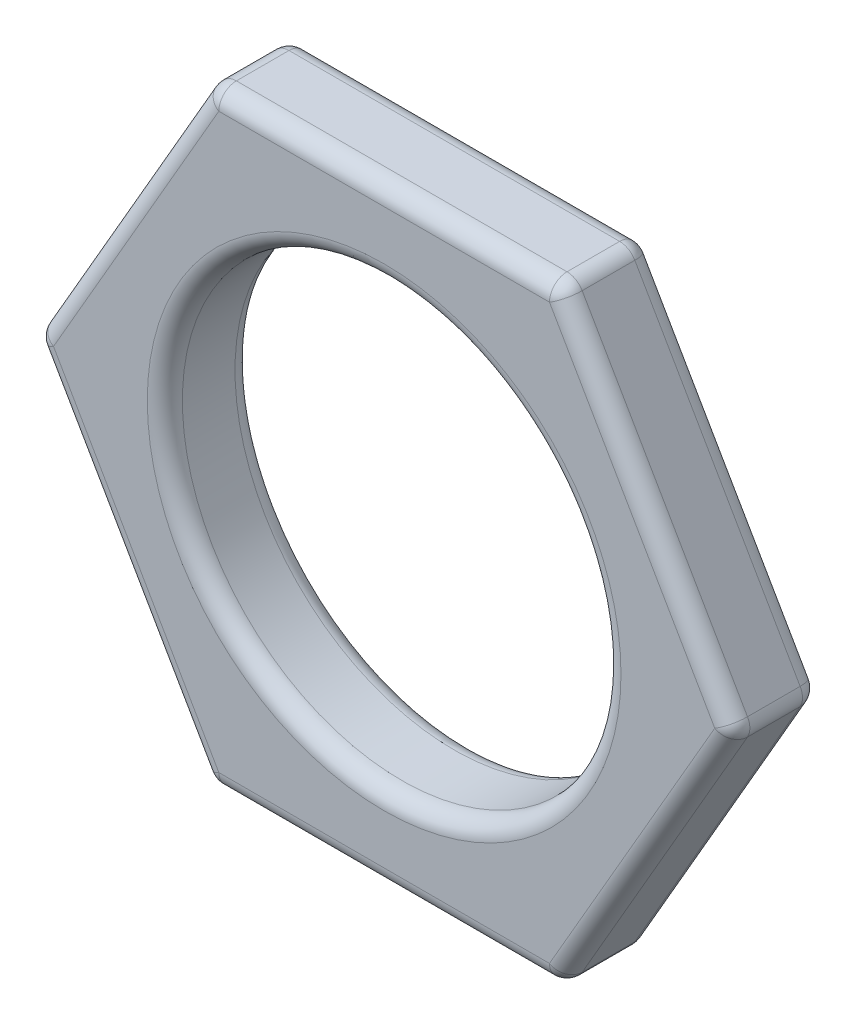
ISO-10303-21;
HEADER;
FILE_DESCRIPTION(('STEP AP214'),'2;1');
FILE_NAME('part.step','',(''),(''),'','','');
FILE_SCHEMA(('AUTOMOTIVE_DESIGN { 1 0 10303 214 1 1 1 1 }'));
ENDSEC;
DATA;
#1=APPLICATION_CONTEXT('core data for automotive mechanical design processes');
#2=APPLICATION_PROTOCOL_DEFINITION('international standard','automotive_design',2000,#1);
#3=PRODUCT_CONTEXT('',#1,'mechanical');
#4=PRODUCT('Part','Part','',(#3));
#5=PRODUCT_RELATED_PRODUCT_CATEGORY('part','',(#4));
#6=PRODUCT_DEFINITION_FORMATION('','',#4);
#7=PRODUCT_DEFINITION_CONTEXT('part definition',#1,'design');
#8=PRODUCT_DEFINITION('design','',#6,#7);
#9=PRODUCT_DEFINITION_SHAPE('','',#8);
#10=(LENGTH_UNIT() NAMED_UNIT(*) SI_UNIT(.MILLI.,.METRE.));
#11=(NAMED_UNIT(*) PLANE_ANGLE_UNIT() SI_UNIT($,.RADIAN.));
#12=(NAMED_UNIT(*) SI_UNIT($,.STERADIAN.) SOLID_ANGLE_UNIT());
#13=UNCERTAINTY_MEASURE_WITH_UNIT(LENGTH_MEASURE(1.E-05),#10,'distance_accuracy_value','');
#14=(GEOMETRIC_REPRESENTATION_CONTEXT(3) GLOBAL_UNCERTAINTY_ASSIGNED_CONTEXT((#13)) GLOBAL_UNIT_ASSIGNED_CONTEXT((#10,
#11,#12)) REPRESENTATION_CONTEXT('',''));
#15=CARTESIAN_POINT('',(0.,0.,0.));
#16=DIRECTION('',(0.,0.,1.));
#17=DIRECTION('',(1.,0.,0.));
#18=AXIS2_PLACEMENT_3D('',#15,#16,#17);
#19=CARTESIAN_POINT('',(9.525,5.4992613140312,1.5875));
#20=DIRECTION('',(0.,0.,1.));
#21=DIRECTION('',(1.,0.,0.));
#22=AXIS2_PLACEMENT_3D('',#19,#20,#21);
#23=PLANE('',#22);
#24=CARTESIAN_POINT('',(0.,0.,1.5875));
#25=DIRECTION('',(0.,0.,1.));
#26=DIRECTION('',(1.,0.,0.));
#27=AXIS2_PLACEMENT_3D('',#24,#25,#26);
#28=CIRCLE('',#27,4.28625);
#29=CARTESIAN_POINT('',(4.28625,0.,1.5875));
#30=VERTEX_POINT('',#29);
#31=EDGE_CURVE('E11',#30,#30,#28,.F.);
#32=ORIENTED_EDGE('',*,*,#31,.T.);
#33=EDGE_LOOP('',(#32));
#34=FACE_BOUND('',#33,.T.);
#35=DIRECTION('',(0.500000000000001,-0.866025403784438,0.));
#36=VECTOR('',#35,1.);
#37=CARTESIAN_POINT('',(-2.90003693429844,-5.34051131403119,1.5875));
#38=LINE('',#37,#36);
#39=CARTESIAN_POINT('',(-5.9833825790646,0.,1.5875));
#40=VERTEX_POINT('',#39);
#41=CARTESIAN_POINT('',(-2.99169128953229,-5.18176131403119,1.5875));
#42=VERTEX_POINT('',#41);
#43=EDGE_CURVE('E59',#40,#42,#38,.T.);
#44=ORIENTED_EDGE('',*,*,#43,.T.);
#45=DIRECTION('',(1.,0.,0.));
#46=VECTOR('',#45,1.);
#47=CARTESIAN_POINT('',(3.17500000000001,-5.18176131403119,1.5875));
#48=LINE('',#47,#46);
#49=CARTESIAN_POINT('',(2.9916912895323,-5.18176131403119,1.5875));
#50=VERTEX_POINT('',#49);
#51=EDGE_CURVE('E49',#42,#50,#48,.T.);
#52=ORIENTED_EDGE('',*,*,#51,.T.);
#53=DIRECTION('',(0.499999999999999,0.866025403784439,0.));
#54=VECTOR('',#53,1.);
#55=CARTESIAN_POINT('',(6.07503693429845,0.158750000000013,1.5875));
#56=LINE('',#55,#54);
#57=CARTESIAN_POINT('',(5.9833825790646,0.,1.5875));
#58=VERTEX_POINT('',#57);
#59=EDGE_CURVE('E277',#50,#58,#56,.T.);
#60=ORIENTED_EDGE('',*,*,#59,.T.);
#61=DIRECTION('',(-0.500000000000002,0.866025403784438,0.));
#62=VECTOR('',#61,1.);
#63=CARTESIAN_POINT('',(2.90003693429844,5.3405113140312,1.5875));
#64=LINE('',#63,#62);
#65=CARTESIAN_POINT('',(2.99169128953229,5.1817613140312,1.5875));
#66=VERTEX_POINT('',#65);
#67=EDGE_CURVE('E279',#58,#66,#64,.T.);
#68=ORIENTED_EDGE('',*,*,#67,.T.);
#69=DIRECTION('',(-1.,0.,0.));
#70=VECTOR('',#69,1.);
#71=CARTESIAN_POINT('',(-3.175,5.1817613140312,1.5875));
#72=LINE('',#71,#70);
#73=CARTESIAN_POINT('',(-2.9916912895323,5.1817613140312,1.5875));
#74=VERTEX_POINT('',#73);
#75=EDGE_CURVE('E278',#66,#74,#72,.T.);
#76=ORIENTED_EDGE('',*,*,#75,.T.);
#77=DIRECTION('',(-0.500000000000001,-0.866025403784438,0.));
#78=VECTOR('',#77,1.);
#79=CARTESIAN_POINT('',(-6.07503693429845,-0.158749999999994,1.5875));
#80=LINE('',#79,#78);
#81=EDGE_CURVE('E62',#74,#40,#80,.T.);
#82=ORIENTED_EDGE('',*,*,#81,.T.);
#83=EDGE_LOOP('',(#44,#52,#60,#68,#76,#82));
#84=FACE_BOUND('',#83,.T.);
#85=ADVANCED_FACE('F41',(#34,#84),#23,.T.);
#86=CARTESIAN_POINT('',(9.525,5.4992613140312,0.));
#87=DIRECTION('',(0.,0.,1.));
#88=DIRECTION('',(1.,0.,0.));
#89=AXIS2_PLACEMENT_3D('',#86,#87,#88);
#90=PLANE('',#89);
#91=CARTESIAN_POINT('',(0.,0.,0.));
#92=DIRECTION('',(0.,0.,1.));
#93=DIRECTION('',(1.,0.,0.));
#94=AXIS2_PLACEMENT_3D('',#91,#92,#93);
#95=CIRCLE('',#94,4.28625);
#96=CARTESIAN_POINT('',(4.28625,0.,0.));
#97=VERTEX_POINT('',#96);
#98=EDGE_CURVE('E270',#97,#97,#95,.T.);
#99=ORIENTED_EDGE('',*,*,#98,.T.);
#100=EDGE_LOOP('',(#99));
#101=FACE_BOUND('',#100,.T.);
#102=DIRECTION('',(-1.,0.,0.));
#103=VECTOR('',#102,1.);
#104=CARTESIAN_POINT('',(9.525,5.1817613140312,0.));
#105=LINE('',#104,#103);
#106=CARTESIAN_POINT('',(-2.99169128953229,5.1817613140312,0.));
#107=VERTEX_POINT('',#106);
#108=CARTESIAN_POINT('',(2.99169128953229,5.1817613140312,0.));
#109=VERTEX_POINT('',#108);
#110=EDGE_CURVE('E265',#107,#109,#105,.F.);
#111=ORIENTED_EDGE('',*,*,#110,.T.);
#112=DIRECTION('',(-0.500000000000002,0.866025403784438,0.));
#113=VECTOR('',#112,1.);
#114=CARTESIAN_POINT('',(4.48753693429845,2.5908806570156,0.));
#115=LINE('',#114,#113);
#116=CARTESIAN_POINT('',(5.9833825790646,0.,0.));
#117=VERTEX_POINT('',#116);
#118=EDGE_CURVE('E262',#109,#117,#115,.F.);
#119=ORIENTED_EDGE('',*,*,#118,.T.);
#120=DIRECTION('',(0.499999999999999,0.866025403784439,0.));
#121=VECTOR('',#120,1.);
#122=CARTESIAN_POINT('',(9.25003693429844,5.65801131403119,0.));
#123=LINE('',#122,#121);
#124=CARTESIAN_POINT('',(2.9916912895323,-5.18176131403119,0.));
#125=VERTEX_POINT('',#124);
#126=EDGE_CURVE('E255',#117,#125,#123,.F.);
#127=ORIENTED_EDGE('',*,*,#126,.T.);
#128=DIRECTION('',(1.,0.,0.));
#129=VECTOR('',#128,1.);
#130=CARTESIAN_POINT('',(9.525,-5.18176131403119,0.));
#131=LINE('',#130,#129);
#132=CARTESIAN_POINT('',(-2.99169128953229,-5.18176131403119,0.));
#133=VERTEX_POINT('',#132);
#134=EDGE_CURVE('E258',#125,#133,#131,.F.);
#135=ORIENTED_EDGE('',*,*,#134,.T.);
#136=DIRECTION('',(0.500000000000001,-0.866025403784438,0.));
#137=VECTOR('',#136,1.);
#138=CARTESIAN_POINT('',(-4.48753693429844,-2.5908806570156,0.));
#139=LINE('',#138,#137);
#140=CARTESIAN_POINT('',(-5.9833825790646,0.,0.));
#141=VERTEX_POINT('',#140);
#142=EDGE_CURVE('E256',#133,#141,#139,.F.);
#143=ORIENTED_EDGE('',*,*,#142,.T.);
#144=DIRECTION('',(-0.500000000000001,-0.866025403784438,0.));
#145=VECTOR('',#144,1.);
#146=CARTESIAN_POINT('',(0.274963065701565,10.8397726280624,0.));
#147=LINE('',#146,#145);
#148=EDGE_CURVE('E257',#141,#107,#147,.F.);
#149=ORIENTED_EDGE('',*,*,#148,.T.);
#150=EDGE_LOOP('',(#111,#119,#127,#135,#143,#149));
#151=FACE_BOUND('',#150,.T.);
#152=ADVANCED_FACE('F382',(#101,#151),#90,.F.);
#153=CARTESIAN_POINT('',(3.17500000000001,-5.49926131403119,1.5875));
#154=DIRECTION('',(-0.866025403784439,0.499999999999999,0.));
#155=DIRECTION('',(-0.499999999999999,-0.866025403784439,0.));
#156=AXIS2_PLACEMENT_3D('',#153,#154,#155);
#157=PLANE('',#156);
#158=DIRECTION('',(0.,0.,-1.));
#159=VECTOR('',#158,1.);
#160=CARTESIAN_POINT('',(3.26665435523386,-5.34051131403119,1.5875));
#161=LINE('',#160,#159);
#162=CARTESIAN_POINT('',(3.26665435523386,-5.34051131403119,1.27));
#163=VERTEX_POINT('',#162);
#164=CARTESIAN_POINT('',(3.26665435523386,-5.34051131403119,0.3175));
#165=VERTEX_POINT('',#164);
#166=EDGE_CURVE('E178',#163,#165,#161,.T.);
#167=ORIENTED_EDGE('',*,*,#166,.T.);
#168=DIRECTION('',(0.499999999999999,0.866025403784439,0.));
#169=VECTOR('',#168,1.);
#170=CARTESIAN_POINT('',(3.17500000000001,-5.49926131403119,0.3175));
#171=LINE('',#170,#169);
#172=CARTESIAN_POINT('',(6.25834564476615,-0.158749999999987,0.3175));
#173=VERTEX_POINT('',#172);
#174=EDGE_CURVE('E174',#165,#173,#171,.T.);
#175=ORIENTED_EDGE('',*,*,#174,.T.);
#176=DIRECTION('',(0.,0.,-1.));
#177=VECTOR('',#176,1.);
#178=CARTESIAN_POINT('',(6.25834564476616,-0.158749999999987,1.5875));
#179=LINE('',#178,#177);
#180=CARTESIAN_POINT('',(6.25834564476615,-0.158749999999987,1.27));
#181=VERTEX_POINT('',#180);
#182=EDGE_CURVE('E170',#173,#181,#179,.F.);
#183=ORIENTED_EDGE('',*,*,#182,.T.);
#184=DIRECTION('',(0.499999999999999,0.866025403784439,0.));
#185=VECTOR('',#184,1.);
#186=CARTESIAN_POINT('',(3.17500000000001,-5.49926131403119,1.27));
#187=LINE('',#186,#185);
#188=EDGE_CURVE('E175',#181,#163,#187,.F.);
#189=ORIENTED_EDGE('',*,*,#188,.T.);
#190=EDGE_LOOP('',(#167,#175,#183,#189));
#191=FACE_BOUND('',#190,.T.);
#192=ADVANCED_FACE('F168',(#191),#157,.F.);
#193=CARTESIAN_POINT('',(6.35000000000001,0.,1.5875));
#194=DIRECTION('',(-0.866025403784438,-0.500000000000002,0.));
#195=DIRECTION('',(0.500000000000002,-0.866025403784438,0.));
#196=AXIS2_PLACEMENT_3D('',#193,#194,#195);
#197=PLANE('',#196);
#198=DIRECTION('',(0.,0.,-1.));
#199=VECTOR('',#198,1.);
#200=CARTESIAN_POINT('',(6.25834564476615,0.158750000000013,1.5875));
#201=LINE('',#200,#199);
#202=CARTESIAN_POINT('',(6.25834564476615,0.158750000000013,1.27));
#203=VERTEX_POINT('',#202);
#204=CARTESIAN_POINT('',(6.25834564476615,0.158750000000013,0.3175));
#205=VERTEX_POINT('',#204);
#206=EDGE_CURVE('E186',#203,#205,#201,.T.);
#207=ORIENTED_EDGE('',*,*,#206,.T.);
#208=DIRECTION('',(-0.500000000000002,0.866025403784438,0.));
#209=VECTOR('',#208,1.);
#210=CARTESIAN_POINT('',(6.35000000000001,0.,0.3175));
#211=LINE('',#210,#209);
#212=CARTESIAN_POINT('',(3.26665435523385,5.3405113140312,0.3175));
#213=VERTEX_POINT('',#212);
#214=EDGE_CURVE('E223',#205,#213,#211,.T.);
#215=ORIENTED_EDGE('',*,*,#214,.T.);
#216=DIRECTION('',(0.,0.,-1.));
#217=VECTOR('',#216,1.);
#218=CARTESIAN_POINT('',(3.26665435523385,5.3405113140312,1.5875));
#219=LINE('',#218,#217);
#220=CARTESIAN_POINT('',(3.26665435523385,5.3405113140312,1.27));
#221=VERTEX_POINT('',#220);
#222=EDGE_CURVE('E225',#213,#221,#219,.F.);
#223=ORIENTED_EDGE('',*,*,#222,.T.);
#224=DIRECTION('',(-0.500000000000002,0.866025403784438,0.));
#225=VECTOR('',#224,1.);
#226=CARTESIAN_POINT('',(6.35000000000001,0.,1.27));
#227=LINE('',#226,#225);
#228=EDGE_CURVE('E219',#221,#203,#227,.F.);
#229=ORIENTED_EDGE('',*,*,#228,.T.);
#230=EDGE_LOOP('',(#207,#215,#223,#229));
#231=FACE_BOUND('',#230,.T.);
#232=ADVANCED_FACE('F488',(#231),#197,.F.);
#233=CARTESIAN_POINT('',(3.175,5.4992613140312,1.5875));
#234=DIRECTION('',(0.,-1.,0.));
#235=DIRECTION('',(0.,0.,-1.));
#236=AXIS2_PLACEMENT_3D('',#233,#234,#235);
#237=PLANE('',#236);
#238=DIRECTION('',(0.,0.,-1.));
#239=VECTOR('',#238,1.);
#240=CARTESIAN_POINT('',(2.99169128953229,5.4992613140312,1.5875));
#241=LINE('',#240,#239);
#242=CARTESIAN_POINT('',(2.99169128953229,5.4992613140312,1.27));
#243=VERTEX_POINT('',#242);
#244=CARTESIAN_POINT('',(2.99169128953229,5.4992613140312,0.3175));
#245=VERTEX_POINT('',#244);
#246=EDGE_CURVE('E234',#243,#245,#241,.T.);
#247=ORIENTED_EDGE('',*,*,#246,.T.);
#248=DIRECTION('',(-1.,0.,0.));
#249=VECTOR('',#248,1.);
#250=CARTESIAN_POINT('',(3.175,5.4992613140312,0.3175));
#251=LINE('',#250,#249);
#252=CARTESIAN_POINT('',(-2.99169128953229,5.4992613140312,0.3175));
#253=VERTEX_POINT('',#252);
#254=EDGE_CURVE('E233',#245,#253,#251,.T.);
#255=ORIENTED_EDGE('',*,*,#254,.T.);
#256=DIRECTION('',(0.,0.,-1.));
#257=VECTOR('',#256,1.);
#258=CARTESIAN_POINT('',(-2.9916912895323,5.4992613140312,1.5875));
#259=LINE('',#258,#257);
#260=CARTESIAN_POINT('',(-2.99169128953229,5.4992613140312,1.27));
#261=VERTEX_POINT('',#260);
#262=EDGE_CURVE('E228',#253,#261,#259,.F.);
#263=ORIENTED_EDGE('',*,*,#262,.T.);
#264=DIRECTION('',(-1.,0.,0.));
#265=VECTOR('',#264,1.);
#266=CARTESIAN_POINT('',(3.175,5.4992613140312,1.27));
#267=LINE('',#266,#265);
#268=EDGE_CURVE('E230',#261,#243,#267,.F.);
#269=ORIENTED_EDGE('',*,*,#268,.T.);
#270=EDGE_LOOP('',(#247,#255,#263,#269));
#271=FACE_BOUND('',#270,.T.);
#272=ADVANCED_FACE('F416',(#271),#237,.F.);
#273=CARTESIAN_POINT('',(-3.175,5.4992613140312,1.5875));
#274=DIRECTION('',(0.866025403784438,-0.500000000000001,0.));
#275=DIRECTION('',(0.500000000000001,0.866025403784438,0.));
#276=AXIS2_PLACEMENT_3D('',#273,#274,#275);
#277=PLANE('',#276);
#278=DIRECTION('',(0.,0.,-1.));
#279=VECTOR('',#278,1.);
#280=CARTESIAN_POINT('',(-3.26665435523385,5.3405113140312,1.5875));
#281=LINE('',#280,#279);
#282=CARTESIAN_POINT('',(-3.26665435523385,5.3405113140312,1.27));
#283=VERTEX_POINT('',#282);
#284=CARTESIAN_POINT('',(-3.26665435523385,5.3405113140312,0.3175));
#285=VERTEX_POINT('',#284);
#286=EDGE_CURVE('E250',#283,#285,#281,.T.);
#287=ORIENTED_EDGE('',*,*,#286,.T.);
#288=DIRECTION('',(-0.500000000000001,-0.866025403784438,0.));
#289=VECTOR('',#288,1.);
#290=CARTESIAN_POINT('',(-3.175,5.4992613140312,0.3175));
#291=LINE('',#290,#289);
#292=CARTESIAN_POINT('',(-6.25834564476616,0.158750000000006,0.3175));
#293=VERTEX_POINT('',#292);
#294=EDGE_CURVE('E252',#285,#293,#291,.T.);
#295=ORIENTED_EDGE('',*,*,#294,.T.);
#296=DIRECTION('',(0.,0.,-1.));
#297=VECTOR('',#296,1.);
#298=CARTESIAN_POINT('',(-6.25834564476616,0.158750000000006,1.5875));
#299=LINE('',#298,#297);
#300=CARTESIAN_POINT('',(-6.25834564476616,0.158750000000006,1.27));
#301=VERTEX_POINT('',#300);
#302=EDGE_CURVE('E249',#293,#301,#299,.F.);
#303=ORIENTED_EDGE('',*,*,#302,.T.);
#304=DIRECTION('',(-0.500000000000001,-0.866025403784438,0.));
#305=VECTOR('',#304,1.);
#306=CARTESIAN_POINT('',(-3.175,5.4992613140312,1.27));
#307=LINE('',#306,#305);
#308=EDGE_CURVE('E242',#301,#283,#307,.F.);
#309=ORIENTED_EDGE('',*,*,#308,.T.);
#310=EDGE_LOOP('',(#287,#295,#303,#309));
#311=FACE_BOUND('',#310,.T.);
#312=ADVANCED_FACE('F395',(#311),#277,.F.);
#313=CARTESIAN_POINT('',(-6.35000000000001,0.,1.5875));
#314=DIRECTION('',(0.866025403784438,0.500000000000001,0.));
#315=DIRECTION('',(-0.500000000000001,0.866025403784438,0.));
#316=AXIS2_PLACEMENT_3D('',#313,#314,#315);
#317=PLANE('',#316);
#318=DIRECTION('',(0.,0.,-1.));
#319=VECTOR('',#318,1.);
#320=CARTESIAN_POINT('',(-6.25834564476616,-0.158749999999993,1.5875));
#321=LINE('',#320,#319);
#322=CARTESIAN_POINT('',(-6.25834564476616,-0.158749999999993,1.27));
#323=VERTEX_POINT('',#322);
#324=CARTESIAN_POINT('',(-6.25834564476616,-0.158749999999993,0.3175));
#325=VERTEX_POINT('',#324);
#326=EDGE_CURVE('E236',#323,#325,#321,.T.);
#327=ORIENTED_EDGE('',*,*,#326,.T.);
#328=DIRECTION('',(0.500000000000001,-0.866025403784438,0.));
#329=VECTOR('',#328,1.);
#330=CARTESIAN_POINT('',(-6.35000000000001,0.,0.3175));
#331=LINE('',#330,#329);
#332=CARTESIAN_POINT('',(-3.26665435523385,-5.34051131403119,0.3175));
#333=VERTEX_POINT('',#332);
#334=EDGE_CURVE('E245',#325,#333,#331,.T.);
#335=ORIENTED_EDGE('',*,*,#334,.T.);
#336=DIRECTION('',(0.,0.,-1.));
#337=VECTOR('',#336,1.);
#338=CARTESIAN_POINT('',(-3.26665435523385,-5.34051131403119,1.5875));
#339=LINE('',#338,#337);
#340=CARTESIAN_POINT('',(-3.26665435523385,-5.34051131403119,1.27));
#341=VERTEX_POINT('',#340);
#342=EDGE_CURVE('E238',#333,#341,#339,.F.);
#343=ORIENTED_EDGE('',*,*,#342,.T.);
#344=DIRECTION('',(0.500000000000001,-0.866025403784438,0.));
#345=VECTOR('',#344,1.);
#346=CARTESIAN_POINT('',(-6.35000000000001,0.,1.27));
#347=LINE('',#346,#345);
#348=EDGE_CURVE('E237',#341,#323,#347,.F.);
#349=ORIENTED_EDGE('',*,*,#348,.T.);
#350=EDGE_LOOP('',(#327,#335,#343,#349));
#351=FACE_BOUND('',#350,.T.);
#352=ADVANCED_FACE('F479',(#351),#317,.F.);
#353=CARTESIAN_POINT('',(-3.175,-5.49926131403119,1.5875));
#354=DIRECTION('',(0.,1.,0.));
#355=DIRECTION('',(0.,0.,1.));
#356=AXIS2_PLACEMENT_3D('',#353,#354,#355);
#357=PLANE('',#356);
#358=DIRECTION('',(0.,0.,-1.));
#359=VECTOR('',#358,1.);
#360=CARTESIAN_POINT('',(-2.99169128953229,-5.49926131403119,1.5875));
#361=LINE('',#360,#359);
#362=CARTESIAN_POINT('',(-2.99169128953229,-5.49926131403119,1.27));
#363=VERTEX_POINT('',#362);
#364=CARTESIAN_POINT('',(-2.99169128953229,-5.49926131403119,0.3175));
#365=VERTEX_POINT('',#364);
#366=EDGE_CURVE('E213',#363,#365,#361,.T.);
#367=ORIENTED_EDGE('',*,*,#366,.T.);
#368=DIRECTION('',(1.,0.,0.));
#369=VECTOR('',#368,1.);
#370=CARTESIAN_POINT('',(-3.175,-5.49926131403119,0.3175));
#371=LINE('',#370,#369);
#372=CARTESIAN_POINT('',(2.9916912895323,-5.49926131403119,0.3175));
#373=VERTEX_POINT('',#372);
#374=EDGE_CURVE('E217',#365,#373,#371,.T.);
#375=ORIENTED_EDGE('',*,*,#374,.T.);
#376=DIRECTION('',(0.,0.,-1.));
#377=VECTOR('',#376,1.);
#378=CARTESIAN_POINT('',(2.9916912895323,-5.49926131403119,1.5875));
#379=LINE('',#378,#377);
#380=CARTESIAN_POINT('',(2.9916912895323,-5.49926131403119,1.27));
#381=VERTEX_POINT('',#380);
#382=EDGE_CURVE('E214',#373,#381,#379,.F.);
#383=ORIENTED_EDGE('',*,*,#382,.T.);
#384=DIRECTION('',(1.,0.,0.));
#385=VECTOR('',#384,1.);
#386=CARTESIAN_POINT('',(-3.175,-5.49926131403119,1.27));
#387=LINE('',#386,#385);
#388=EDGE_CURVE('E211',#381,#363,#387,.F.);
#389=ORIENTED_EDGE('',*,*,#388,.T.);
#390=EDGE_LOOP('',(#367,#375,#383,#389));
#391=FACE_BOUND('',#390,.T.);
#392=ADVANCED_FACE('F478',(#391),#357,.F.);
#393=CARTESIAN_POINT('',(0.,0.,1.5875));
#394=DIRECTION('',(0.,0.,-1.));
#395=DIRECTION('',(-1.,0.,0.));
#396=AXIS2_PLACEMENT_3D('',#393,#394,#395);
#397=CYLINDRICAL_SURFACE('',#396,3.96875);
#398=CARTESIAN_POINT('',(0.,0.,0.3175));
#399=DIRECTION('',(0.,0.,1.));
#400=DIRECTION('',(1.,0.,0.));
#401=AXIS2_PLACEMENT_3D('',#398,#399,#400);
#402=CIRCLE('',#401,3.96875);
#403=CARTESIAN_POINT('',(3.96875,0.,0.3175));
#404=VERTEX_POINT('',#403);
#405=EDGE_CURVE('E272',#404,#404,#402,.F.);
#406=ORIENTED_EDGE('',*,*,#405,.T.);
#407=EDGE_LOOP('',(#406));
#408=FACE_BOUND('',#407,.T.);
#409=CARTESIAN_POINT('',(0.,0.,1.27));
#410=DIRECTION('',(0.,0.,1.));
#411=DIRECTION('',(1.,0.,0.));
#412=AXIS2_PLACEMENT_3D('',#409,#410,#411);
#413=CIRCLE('',#412,3.96875);
#414=CARTESIAN_POINT('',(3.96875,0.,1.27));
#415=VERTEX_POINT('',#414);
#416=EDGE_CURVE('E269',#415,#415,#413,.T.);
#417=ORIENTED_EDGE('',*,*,#416,.T.);
#418=EDGE_LOOP('',(#417));
#419=FACE_BOUND('',#418,.T.);
#420=ADVANCED_FACE('F475',(#408,#419),#397,.F.);
#421=CARTESIAN_POINT('',(-2.99169128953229,5.1817613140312,1.5875));
#422=DIRECTION('',(0.,0.,-1.));
#423=DIRECTION('',(-1.,0.,0.));
#424=AXIS2_PLACEMENT_3D('',#421,#422,#423);
#425=CYLINDRICAL_SURFACE('',#424,0.3175);
#426=CARTESIAN_POINT('',(-2.99169128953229,5.1817613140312,1.27));
#427=DIRECTION('',(0.,0.,1.));
#428=DIRECTION('',(1.,0.,0.));
#429=AXIS2_PLACEMENT_3D('',#426,#427,#428);
#430=CIRCLE('',#429,0.3175);
#431=EDGE_CURVE('E44',#261,#283,#430,.T.);
#432=ORIENTED_EDGE('',*,*,#431,.F.);
#433=ORIENTED_EDGE('',*,*,#262,.F.);
#434=CARTESIAN_POINT('',(-2.99169128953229,5.1817613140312,0.3175));
#435=DIRECTION('',(0.,0.,-1.));
#436=DIRECTION('',(-1.,0.,0.));
#437=AXIS2_PLACEMENT_3D('',#434,#435,#436);
#438=CIRCLE('',#437,0.3175);
#439=EDGE_CURVE('E210',#285,#253,#438,.T.);
#440=ORIENTED_EDGE('',*,*,#439,.F.);
#441=ORIENTED_EDGE('',*,*,#286,.F.);
#442=EDGE_LOOP('',(#432,#433,#440,#441));
#443=FACE_BOUND('',#442,.T.);
#444=ADVANCED_FACE('F406',(#443),#425,.T.);
#445=CARTESIAN_POINT('',(-2.99169128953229,5.1817613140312,1.27));
#446=DIRECTION('',(0.,0.,1.));
#447=DIRECTION('',(1.,0.,0.));
#448=AXIS2_PLACEMENT_3D('',#445,#446,#447);
#449=SPHERICAL_SURFACE('',#448,0.3175);
#450=CARTESIAN_POINT('',(-2.9916912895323,5.1817613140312,1.27));
#451=DIRECTION('',(-1.,0.,0.));
#452=DIRECTION('',(0.,-1.,0.));
#453=AXIS2_PLACEMENT_3D('',#450,#451,#452);
#454=CIRCLE('',#453,0.3175);
#455=EDGE_CURVE('E362',#261,#74,#454,.F.);
#456=ORIENTED_EDGE('',*,*,#455,.F.);
#457=ORIENTED_EDGE('',*,*,#431,.T.);
#458=CARTESIAN_POINT('',(-2.99169128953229,5.1817613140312,1.27));
#459=DIRECTION('',(0.5,0.866025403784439,0.));
#460=DIRECTION('',(-0.866025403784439,0.5,0.));
#461=AXIS2_PLACEMENT_3D('',#458,#459,#460);
#462=CIRCLE('',#461,0.3175);
#463=EDGE_CURVE('E364',#74,#283,#462,.F.);
#464=ORIENTED_EDGE('',*,*,#463,.F.);
#465=EDGE_LOOP('',(#456,#457,#464));
#466=FACE_BOUND('',#465,.T.);
#467=ADVANCED_FACE('F407',(#466),#449,.T.);
#468=CARTESIAN_POINT('',(-2.99169128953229,5.1817613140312,0.3175));
#469=DIRECTION('',(0.,0.,1.));
#470=DIRECTION('',(1.,0.,0.));
#471=AXIS2_PLACEMENT_3D('',#468,#469,#470);
#472=SPHERICAL_SURFACE('',#471,0.3175);
#473=CARTESIAN_POINT('',(-2.99169128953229,5.1817613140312,0.3175));
#474=DIRECTION('',(0.5,0.866025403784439,0.));
#475=DIRECTION('',(-0.866025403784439,0.5,0.));
#476=AXIS2_PLACEMENT_3D('',#473,#474,#475);
#477=CIRCLE('',#476,0.3175);
#478=EDGE_CURVE('E358',#285,#107,#477,.F.);
#479=ORIENTED_EDGE('',*,*,#478,.F.);
#480=ORIENTED_EDGE('',*,*,#439,.T.);
#481=CARTESIAN_POINT('',(-2.99169128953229,5.1817613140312,0.3175));
#482=DIRECTION('',(-1.,0.,0.));
#483=DIRECTION('',(0.,0.,1.));
#484=AXIS2_PLACEMENT_3D('',#481,#482,#483);
#485=CIRCLE('',#484,0.3175);
#486=EDGE_CURVE('E360',#107,#253,#485,.F.);
#487=ORIENTED_EDGE('',*,*,#486,.F.);
#488=EDGE_LOOP('',(#479,#480,#487));
#489=FACE_BOUND('',#488,.T.);
#490=ADVANCED_FACE('F375',(#489),#472,.T.);
#491=CARTESIAN_POINT('',(0.274963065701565,10.8397726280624,1.27));
#492=DIRECTION('',(0.500000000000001,0.866025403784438,0.));
#493=DIRECTION('',(-0.866025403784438,0.500000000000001,0.));
#494=AXIS2_PLACEMENT_3D('',#491,#492,#493);
#495=CYLINDRICAL_SURFACE('',#494,0.3175);
#496=ORIENTED_EDGE('',*,*,#463,.T.);
#497=ORIENTED_EDGE('',*,*,#308,.F.);
#498=CARTESIAN_POINT('',(-5.9833825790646,0.,1.27));
#499=DIRECTION('',(-0.499999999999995,-0.866025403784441,0.));
#500=DIRECTION('',(0.866025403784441,-0.499999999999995,0.));
#501=AXIS2_PLACEMENT_3D('',#498,#499,#500);
#502=CIRCLE('',#501,0.3175);
#503=EDGE_CURVE('E348',#40,#301,#502,.T.);
#504=ORIENTED_EDGE('',*,*,#503,.F.);
#505=ORIENTED_EDGE('',*,*,#81,.F.);
#506=EDGE_LOOP('',(#496,#497,#504,#505));
#507=FACE_BOUND('',#506,.T.);
#508=ADVANCED_FACE('F404',(#507),#495,.T.);
#509=CARTESIAN_POINT('',(9.525,5.1817613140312,1.27));
#510=DIRECTION('',(1.,0.,0.));
#511=DIRECTION('',(0.,0.,-1.));
#512=AXIS2_PLACEMENT_3D('',#509,#510,#511);
#513=CYLINDRICAL_SURFACE('',#512,0.3175);
#514=ORIENTED_EDGE('',*,*,#455,.T.);
#515=ORIENTED_EDGE('',*,*,#75,.F.);
#516=CARTESIAN_POINT('',(2.99169128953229,5.1817613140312,1.27));
#517=DIRECTION('',(1.,0.,0.));
#518=DIRECTION('',(0.,0.,-1.));
#519=AXIS2_PLACEMENT_3D('',#516,#517,#518);
#520=CIRCLE('',#519,0.3175);
#521=EDGE_CURVE('E350',#243,#66,#520,.T.);
#522=ORIENTED_EDGE('',*,*,#521,.F.);
#523=ORIENTED_EDGE('',*,*,#268,.F.);
#524=EDGE_LOOP('',(#514,#515,#522,#523));
#525=FACE_BOUND('',#524,.T.);
#526=ADVANCED_FACE('F411',(#525),#513,.T.);
#527=CARTESIAN_POINT('',(2.99169128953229,5.1817613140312,1.5875));
#528=DIRECTION('',(0.,0.,-1.));
#529=DIRECTION('',(-1.,0.,0.));
#530=AXIS2_PLACEMENT_3D('',#527,#528,#529);
#531=CYLINDRICAL_SURFACE('',#530,0.3175);
#532=CARTESIAN_POINT('',(2.99169128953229,5.1817613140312,0.3175));
#533=DIRECTION('',(0.,0.,-1.));
#534=DIRECTION('',(-1.,0.,0.));
#535=AXIS2_PLACEMENT_3D('',#532,#533,#534);
#536=CIRCLE('',#535,0.3175);
#537=EDGE_CURVE('E344',#245,#213,#536,.T.);
#538=ORIENTED_EDGE('',*,*,#537,.F.);
#539=ORIENTED_EDGE('',*,*,#246,.F.);
#540=CARTESIAN_POINT('',(2.99169128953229,5.1817613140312,1.27));
#541=DIRECTION('',(0.,0.,1.));
#542=DIRECTION('',(1.,0.,0.));
#543=AXIS2_PLACEMENT_3D('',#540,#541,#542);
#544=CIRCLE('',#543,0.3175);
#545=EDGE_CURVE('E343',#221,#243,#544,.T.);
#546=ORIENTED_EDGE('',*,*,#545,.F.);
#547=ORIENTED_EDGE('',*,*,#222,.F.);
#548=EDGE_LOOP('',(#538,#539,#546,#547));
#549=FACE_BOUND('',#548,.T.);
#550=ADVANCED_FACE('F425',(#549),#531,.T.);
#551=CARTESIAN_POINT('',(3.175,5.1817613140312,0.3175));
#552=DIRECTION('',(-1.,0.,0.));
#553=DIRECTION('',(0.,0.,1.));
#554=AXIS2_PLACEMENT_3D('',#551,#552,#553);
#555=CYLINDRICAL_SURFACE('',#554,0.3175);
#556=ORIENTED_EDGE('',*,*,#486,.T.);
#557=ORIENTED_EDGE('',*,*,#254,.F.);
#558=CARTESIAN_POINT('',(2.99169128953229,5.1817613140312,0.3175));
#559=DIRECTION('',(1.,0.,0.));
#560=DIRECTION('',(0.,0.,-1.));
#561=AXIS2_PLACEMENT_3D('',#558,#559,#560);
#562=CIRCLE('',#561,0.3175);
#563=EDGE_CURVE('E338',#109,#245,#562,.T.);
#564=ORIENTED_EDGE('',*,*,#563,.F.);
#565=ORIENTED_EDGE('',*,*,#110,.F.);
#566=EDGE_LOOP('',(#556,#557,#564,#565));
#567=FACE_BOUND('',#566,.T.);
#568=ADVANCED_FACE('F377',(#567),#555,.T.);
#569=CARTESIAN_POINT('',(-2.90003693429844,5.3405113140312,0.3175));
#570=DIRECTION('',(-0.500000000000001,-0.866025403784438,0.));
#571=DIRECTION('',(0.866025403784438,-0.500000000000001,0.));
#572=AXIS2_PLACEMENT_3D('',#569,#570,#571);
#573=CYLINDRICAL_SURFACE('',#572,0.3175);
#574=ORIENTED_EDGE('',*,*,#478,.T.);
#575=ORIENTED_EDGE('',*,*,#148,.F.);
#576=CARTESIAN_POINT('',(-5.9833825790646,0.,0.3175));
#577=DIRECTION('',(-0.500000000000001,-0.866025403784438,0.));
#578=DIRECTION('',(0.866025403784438,-0.500000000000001,0.));
#579=AXIS2_PLACEMENT_3D('',#576,#577,#578);
#580=CIRCLE('',#579,0.3175);
#581=EDGE_CURVE('E336',#293,#141,#580,.T.);
#582=ORIENTED_EDGE('',*,*,#581,.F.);
#583=ORIENTED_EDGE('',*,*,#294,.F.);
#584=EDGE_LOOP('',(#574,#575,#582,#583));
#585=FACE_BOUND('',#584,.T.);
#586=ADVANCED_FACE('F386',(#585),#573,.T.);
#587=CARTESIAN_POINT('',(-5.9833825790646,0.,1.5875));
#588=DIRECTION('',(0.,0.,-1.));
#589=DIRECTION('',(-1.,0.,0.));
#590=AXIS2_PLACEMENT_3D('',#587,#588,#589);
#591=CYLINDRICAL_SURFACE('',#590,0.3175);
#592=CARTESIAN_POINT('',(-5.9833825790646,0.,1.27));
#593=DIRECTION('',(0.,0.,1.));
#594=DIRECTION('',(1.,0.,0.));
#595=AXIS2_PLACEMENT_3D('',#592,#593,#594);
#596=CIRCLE('',#595,0.3175);
#597=EDGE_CURVE('E355',#301,#323,#596,.T.);
#598=ORIENTED_EDGE('',*,*,#597,.F.);
#599=ORIENTED_EDGE('',*,*,#302,.F.);
#600=CARTESIAN_POINT('',(-5.9833825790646,0.,0.3175));
#601=DIRECTION('',(0.,0.,-1.));
#602=DIRECTION('',(-1.,0.,0.));
#603=AXIS2_PLACEMENT_3D('',#600,#601,#602);
#604=CIRCLE('',#603,0.3175);
#605=EDGE_CURVE('E334',#325,#293,#604,.T.);
#606=ORIENTED_EDGE('',*,*,#605,.F.);
#607=ORIENTED_EDGE('',*,*,#326,.F.);
#608=EDGE_LOOP('',(#598,#599,#606,#607));
#609=FACE_BOUND('',#608,.T.);
#610=ADVANCED_FACE('F396',(#609),#591,.T.);
#611=CARTESIAN_POINT('',(-5.9833825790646,0.,1.27));
#612=DIRECTION('',(0.,0.,1.));
#613=DIRECTION('',(1.,0.,0.));
#614=AXIS2_PLACEMENT_3D('',#611,#612,#613);
#615=SPHERICAL_SURFACE('',#614,0.3175);
#616=ORIENTED_EDGE('',*,*,#503,.T.);
#617=ORIENTED_EDGE('',*,*,#597,.T.);
#618=CARTESIAN_POINT('',(-5.9833825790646,0.,1.27));
#619=DIRECTION('',(-0.500000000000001,0.866025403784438,0.));
#620=DIRECTION('',(-0.866025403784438,-0.500000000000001,0.));
#621=AXIS2_PLACEMENT_3D('',#618,#619,#620);
#622=CIRCLE('',#621,0.3175);
#623=EDGE_CURVE('E329',#40,#323,#622,.F.);
#624=ORIENTED_EDGE('',*,*,#623,.F.);
#625=EDGE_LOOP('',(#616,#617,#624));
#626=FACE_BOUND('',#625,.T.);
#627=ADVANCED_FACE('F405',(#626),#615,.T.);
#628=CARTESIAN_POINT('',(2.99169128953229,5.1817613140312,1.27));
#629=DIRECTION('',(0.,0.,1.));
#630=DIRECTION('',(1.,0.,0.));
#631=AXIS2_PLACEMENT_3D('',#628,#629,#630);
#632=SPHERICAL_SURFACE('',#631,0.3175);
#633=ORIENTED_EDGE('',*,*,#545,.T.);
#634=ORIENTED_EDGE('',*,*,#521,.T.);
#635=CARTESIAN_POINT('',(2.99169128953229,5.1817613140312,1.27));
#636=DIRECTION('',(-0.500000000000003,0.866025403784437,0.));
#637=DIRECTION('',(-0.866025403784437,-0.500000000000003,0.));
#638=AXIS2_PLACEMENT_3D('',#635,#636,#637);
#639=CIRCLE('',#638,0.3175);
#640=EDGE_CURVE('E330',#221,#66,#639,.F.);
#641=ORIENTED_EDGE('',*,*,#640,.F.);
#642=EDGE_LOOP('',(#633,#634,#641));
#643=FACE_BOUND('',#642,.T.);
#644=ADVANCED_FACE('F465',(#643),#632,.T.);
#645=CARTESIAN_POINT('',(2.99169128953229,5.1817613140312,0.3175));
#646=DIRECTION('',(0.,0.,1.));
#647=DIRECTION('',(1.,0.,0.));
#648=AXIS2_PLACEMENT_3D('',#645,#646,#647);
#649=SPHERICAL_SURFACE('',#648,0.3175);
#650=ORIENTED_EDGE('',*,*,#563,.T.);
#651=ORIENTED_EDGE('',*,*,#537,.T.);
#652=CARTESIAN_POINT('',(2.99169128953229,5.1817613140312,0.3175));
#653=DIRECTION('',(-0.500000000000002,0.866025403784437,0.));
#654=DIRECTION('',(-0.866025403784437,-0.500000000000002,0.));
#655=AXIS2_PLACEMENT_3D('',#652,#653,#654);
#656=CIRCLE('',#655,0.3175);
#657=EDGE_CURVE('E322',#109,#213,#656,.F.);
#658=ORIENTED_EDGE('',*,*,#657,.F.);
#659=EDGE_LOOP('',(#650,#651,#658));
#660=FACE_BOUND('',#659,.T.);
#661=ADVANCED_FACE('F426',(#660),#649,.T.);
#662=CARTESIAN_POINT('',(-5.9833825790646,0.,0.3175));
#663=DIRECTION('',(0.,0.,1.));
#664=DIRECTION('',(1.,0.,0.));
#665=AXIS2_PLACEMENT_3D('',#662,#663,#664);
#666=SPHERICAL_SURFACE('',#665,0.3175);
#667=ORIENTED_EDGE('',*,*,#605,.T.);
#668=ORIENTED_EDGE('',*,*,#581,.T.);
#669=CARTESIAN_POINT('',(-5.9833825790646,0.,0.3175));
#670=DIRECTION('',(-0.499999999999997,0.86602540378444,0.));
#671=DIRECTION('',(-0.86602540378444,-0.499999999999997,0.));
#672=AXIS2_PLACEMENT_3D('',#669,#670,#671);
#673=CIRCLE('',#672,0.3175);
#674=EDGE_CURVE('E321',#325,#141,#673,.F.);
#675=ORIENTED_EDGE('',*,*,#674,.F.);
#676=EDGE_LOOP('',(#667,#668,#675));
#677=FACE_BOUND('',#676,.T.);
#678=ADVANCED_FACE('F451',(#677),#666,.T.);
#679=CARTESIAN_POINT('',(-4.48753693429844,-2.5908806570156,1.27));
#680=DIRECTION('',(-0.500000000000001,0.866025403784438,0.));
#681=DIRECTION('',(-0.866025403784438,-0.500000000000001,0.));
#682=AXIS2_PLACEMENT_3D('',#679,#680,#681);
#683=CYLINDRICAL_SURFACE('',#682,0.3175);
#684=ORIENTED_EDGE('',*,*,#623,.T.);
#685=ORIENTED_EDGE('',*,*,#348,.F.);
#686=CARTESIAN_POINT('',(-2.99169128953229,-5.18176131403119,1.27));
#687=DIRECTION('',(0.499999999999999,-0.866025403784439,0.));
#688=DIRECTION('',(0.866025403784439,0.499999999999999,0.));
#689=AXIS2_PLACEMENT_3D('',#686,#687,#688);
#690=CIRCLE('',#689,0.3175);
#691=EDGE_CURVE('E316',#42,#341,#690,.T.);
#692=ORIENTED_EDGE('',*,*,#691,.F.);
#693=ORIENTED_EDGE('',*,*,#43,.F.);
#694=EDGE_LOOP('',(#684,#685,#692,#693));
#695=FACE_BOUND('',#694,.T.);
#696=ADVANCED_FACE('F453',(#695),#683,.T.);
#697=CARTESIAN_POINT('',(4.48753693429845,2.5908806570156,1.27));
#698=DIRECTION('',(0.500000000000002,-0.866025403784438,0.));
#699=DIRECTION('',(0.866025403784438,0.500000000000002,0.));
#700=AXIS2_PLACEMENT_3D('',#697,#698,#699);
#701=CYLINDRICAL_SURFACE('',#700,0.3175);
#702=ORIENTED_EDGE('',*,*,#640,.T.);
#703=ORIENTED_EDGE('',*,*,#67,.F.);
#704=CARTESIAN_POINT('',(5.9833825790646,0.,1.27));
#705=DIRECTION('',(0.500000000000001,-0.866025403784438,0.));
#706=DIRECTION('',(0.866025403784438,0.500000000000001,0.));
#707=AXIS2_PLACEMENT_3D('',#704,#705,#706);
#708=CIRCLE('',#707,0.3175);
#709=EDGE_CURVE('E193',#203,#58,#708,.T.);
#710=ORIENTED_EDGE('',*,*,#709,.F.);
#711=ORIENTED_EDGE('',*,*,#228,.F.);
#712=EDGE_LOOP('',(#702,#703,#710,#711));
#713=FACE_BOUND('',#712,.T.);
#714=ADVANCED_FACE('F458',(#713),#701,.T.);
#715=CARTESIAN_POINT('',(5.9833825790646,0.,1.5875));
#716=DIRECTION('',(0.,0.,-1.));
#717=DIRECTION('',(-1.,0.,0.));
#718=AXIS2_PLACEMENT_3D('',#715,#716,#717);
#719=CYLINDRICAL_SURFACE('',#718,0.3175);
#720=CARTESIAN_POINT('',(5.9833825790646,0.,0.3175));
#721=DIRECTION('',(0.,0.,-1.));
#722=DIRECTION('',(-1.,0.,0.));
#723=AXIS2_PLACEMENT_3D('',#720,#721,#722);
#724=CIRCLE('',#723,0.3175);
#725=EDGE_CURVE('E194',#205,#173,#724,.T.);
#726=ORIENTED_EDGE('',*,*,#725,.F.);
#727=ORIENTED_EDGE('',*,*,#206,.F.);
#728=CARTESIAN_POINT('',(5.9833825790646,0.,1.27));
#729=DIRECTION('',(0.,0.,1.));
#730=DIRECTION('',(1.,0.,0.));
#731=AXIS2_PLACEMENT_3D('',#728,#729,#730);
#732=CIRCLE('',#731,0.3175);
#733=EDGE_CURVE('E181',#181,#203,#732,.T.);
#734=ORIENTED_EDGE('',*,*,#733,.F.);
#735=ORIENTED_EDGE('',*,*,#182,.F.);
#736=EDGE_LOOP('',(#726,#727,#734,#735));
#737=FACE_BOUND('',#736,.T.);
#738=ADVANCED_FACE('F183',(#737),#719,.T.);
#739=CARTESIAN_POINT('',(6.07503693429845,-0.158749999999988,0.3175));
#740=DIRECTION('',(-0.500000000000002,0.866025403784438,0.));
#741=DIRECTION('',(-0.866025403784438,-0.500000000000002,0.));
#742=AXIS2_PLACEMENT_3D('',#739,#740,#741);
#743=CYLINDRICAL_SURFACE('',#742,0.3175);
#744=ORIENTED_EDGE('',*,*,#657,.T.);
#745=ORIENTED_EDGE('',*,*,#214,.F.);
#746=CARTESIAN_POINT('',(5.9833825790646,0.,0.3175));
#747=DIRECTION('',(0.500000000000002,-0.866025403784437,0.));
#748=DIRECTION('',(0.866025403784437,0.500000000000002,0.));
#749=AXIS2_PLACEMENT_3D('',#746,#747,#748);
#750=CIRCLE('',#749,0.3175);
#751=EDGE_CURVE('E315',#117,#205,#750,.T.);
#752=ORIENTED_EDGE('',*,*,#751,.F.);
#753=ORIENTED_EDGE('',*,*,#118,.F.);
#754=EDGE_LOOP('',(#744,#745,#752,#753));
#755=FACE_BOUND('',#754,.T.);
#756=ADVANCED_FACE('F427',(#755),#743,.T.);
#757=CARTESIAN_POINT('',(-6.07503693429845,0.158750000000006,0.3175));
#758=DIRECTION('',(0.500000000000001,-0.866025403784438,0.));
#759=DIRECTION('',(0.866025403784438,0.500000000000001,0.));
#760=AXIS2_PLACEMENT_3D('',#757,#758,#759);
#761=CYLINDRICAL_SURFACE('',#760,0.3175);
#762=ORIENTED_EDGE('',*,*,#674,.T.);
#763=ORIENTED_EDGE('',*,*,#142,.F.);
#764=CARTESIAN_POINT('',(-2.99169128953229,-5.18176131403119,0.3175));
#765=DIRECTION('',(0.5,-0.866025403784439,0.));
#766=DIRECTION('',(0.866025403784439,0.5,0.));
#767=AXIS2_PLACEMENT_3D('',#764,#765,#766);
#768=CIRCLE('',#767,0.3175);
#769=EDGE_CURVE('E310',#333,#133,#768,.T.);
#770=ORIENTED_EDGE('',*,*,#769,.F.);
#771=ORIENTED_EDGE('',*,*,#334,.F.);
#772=EDGE_LOOP('',(#762,#763,#770,#771));
#773=FACE_BOUND('',#772,.T.);
#774=ADVANCED_FACE('F449',(#773),#761,.T.);
#775=CARTESIAN_POINT('',(-2.99169128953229,-5.18176131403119,1.5875));
#776=DIRECTION('',(0.,0.,-1.));
#777=DIRECTION('',(-1.,0.,0.));
#778=AXIS2_PLACEMENT_3D('',#775,#776,#777);
#779=CYLINDRICAL_SURFACE('',#778,0.3175);
#780=CARTESIAN_POINT('',(-2.99169128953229,-5.18176131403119,1.27));
#781=DIRECTION('',(0.,0.,1.));
#782=DIRECTION('',(1.,0.,0.));
#783=AXIS2_PLACEMENT_3D('',#780,#781,#782);
#784=CIRCLE('',#783,0.3175);
#785=EDGE_CURVE('E318',#341,#363,#784,.T.);
#786=ORIENTED_EDGE('',*,*,#785,.F.);
#787=ORIENTED_EDGE('',*,*,#342,.F.);
#788=CARTESIAN_POINT('',(-2.99169128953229,-5.18176131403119,0.3175));
#789=DIRECTION('',(0.,0.,-1.));
#790=DIRECTION('',(-1.,0.,0.));
#791=AXIS2_PLACEMENT_3D('',#788,#789,#790);
#792=CIRCLE('',#791,0.3175);
#793=EDGE_CURVE('E308',#365,#333,#792,.T.);
#794=ORIENTED_EDGE('',*,*,#793,.F.);
#795=ORIENTED_EDGE('',*,*,#366,.F.);
#796=EDGE_LOOP('',(#786,#787,#794,#795));
#797=FACE_BOUND('',#796,.T.);
#798=ADVANCED_FACE('F528',(#797),#779,.T.);
#799=CARTESIAN_POINT('',(-2.99169128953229,-5.18176131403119,1.27));
#800=DIRECTION('',(0.,0.,1.));
#801=DIRECTION('',(1.,0.,0.));
#802=AXIS2_PLACEMENT_3D('',#799,#800,#801);
#803=SPHERICAL_SURFACE('',#802,0.3175);
#804=ORIENTED_EDGE('',*,*,#691,.T.);
#805=ORIENTED_EDGE('',*,*,#785,.T.);
#806=CARTESIAN_POINT('',(-2.99169128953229,-5.18176131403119,1.27));
#807=DIRECTION('',(-1.,0.,0.));
#808=DIRECTION('',(0.,0.,1.));
#809=AXIS2_PLACEMENT_3D('',#806,#807,#808);
#810=CIRCLE('',#809,0.3175);
#811=EDGE_CURVE('E200',#42,#363,#810,.F.);
#812=ORIENTED_EDGE('',*,*,#811,.F.);
#813=EDGE_LOOP('',(#804,#805,#812));
#814=FACE_BOUND('',#813,.T.);
#815=ADVANCED_FACE('F522',(#814),#803,.T.);
#816=CARTESIAN_POINT('',(5.9833825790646,0.,1.27));
#817=DIRECTION('',(0.,0.,1.));
#818=DIRECTION('',(1.,0.,0.));
#819=AXIS2_PLACEMENT_3D('',#816,#817,#818);
#820=SPHERICAL_SURFACE('',#819,0.3175);
#821=ORIENTED_EDGE('',*,*,#733,.T.);
#822=ORIENTED_EDGE('',*,*,#709,.T.);
#823=CARTESIAN_POINT('',(5.9833825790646,0.,1.27));
#824=DIRECTION('',(0.499999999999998,0.86602540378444,0.));
#825=DIRECTION('',(-0.86602540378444,0.499999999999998,0.));
#826=AXIS2_PLACEMENT_3D('',#823,#824,#825);
#827=CIRCLE('',#826,0.3175);
#828=EDGE_CURVE('E191',#181,#58,#827,.F.);
#829=ORIENTED_EDGE('',*,*,#828,.F.);
#830=EDGE_LOOP('',(#821,#822,#829));
#831=FACE_BOUND('',#830,.T.);
#832=ADVANCED_FACE('F198',(#831),#820,.T.);
#833=CARTESIAN_POINT('',(5.9833825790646,0.,0.3175));
#834=DIRECTION('',(0.,0.,1.));
#835=DIRECTION('',(1.,0.,0.));
#836=AXIS2_PLACEMENT_3D('',#833,#834,#835);
#837=SPHERICAL_SURFACE('',#836,0.3175);
#838=ORIENTED_EDGE('',*,*,#751,.T.);
#839=ORIENTED_EDGE('',*,*,#725,.T.);
#840=CARTESIAN_POINT('',(5.9833825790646,0.,0.3175));
#841=DIRECTION('',(0.499999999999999,0.866025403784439,0.));
#842=DIRECTION('',(-0.866025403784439,0.499999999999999,0.));
#843=AXIS2_PLACEMENT_3D('',#840,#841,#842);
#844=CIRCLE('',#843,0.3175);
#845=EDGE_CURVE('E199',#117,#173,#844,.F.);
#846=ORIENTED_EDGE('',*,*,#845,.F.);
#847=EDGE_LOOP('',(#838,#839,#846));
#848=FACE_BOUND('',#847,.T.);
#849=ADVANCED_FACE('F433',(#848),#837,.T.);
#850=CARTESIAN_POINT('',(-2.99169128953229,-5.18176131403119,0.3175));
#851=DIRECTION('',(0.,0.,1.));
#852=DIRECTION('',(1.,0.,0.));
#853=AXIS2_PLACEMENT_3D('',#850,#851,#852);
#854=SPHERICAL_SURFACE('',#853,0.3175);
#855=ORIENTED_EDGE('',*,*,#793,.T.);
#856=ORIENTED_EDGE('',*,*,#769,.T.);
#857=CARTESIAN_POINT('',(-2.99169128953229,-5.18176131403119,0.3175));
#858=DIRECTION('',(-1.,0.,0.));
#859=DIRECTION('',(0.,-1.,0.));
#860=AXIS2_PLACEMENT_3D('',#857,#858,#859);
#861=CIRCLE('',#860,0.3175);
#862=EDGE_CURVE('E298',#365,#133,#861,.F.);
#863=ORIENTED_EDGE('',*,*,#862,.F.);
#864=EDGE_LOOP('',(#855,#856,#863));
#865=FACE_BOUND('',#864,.T.);
#866=ADVANCED_FACE('F443',(#865),#854,.T.);
#867=CARTESIAN_POINT('',(9.525,-5.18176131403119,1.27));
#868=DIRECTION('',(-1.,0.,0.));
#869=DIRECTION('',(0.,0.,1.));
#870=AXIS2_PLACEMENT_3D('',#867,#868,#869);
#871=CYLINDRICAL_SURFACE('',#870,0.3175);
#872=ORIENTED_EDGE('',*,*,#811,.T.);
#873=ORIENTED_EDGE('',*,*,#388,.F.);
#874=CARTESIAN_POINT('',(2.9916912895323,-5.18176131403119,1.27));
#875=DIRECTION('',(1.,0.,0.));
#876=DIRECTION('',(0.,1.,0.));
#877=AXIS2_PLACEMENT_3D('',#874,#875,#876);
#878=CIRCLE('',#877,0.3175);
#879=EDGE_CURVE('E299',#50,#381,#878,.T.);
#880=ORIENTED_EDGE('',*,*,#879,.F.);
#881=ORIENTED_EDGE('',*,*,#51,.F.);
#882=EDGE_LOOP('',(#872,#873,#880,#881));
#883=FACE_BOUND('',#882,.T.);
#884=ADVANCED_FACE('F511',(#883),#871,.T.);
#885=CARTESIAN_POINT('',(9.25003693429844,5.65801131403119,1.27));
#886=DIRECTION('',(-0.499999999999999,-0.866025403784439,0.));
#887=DIRECTION('',(0.866025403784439,-0.499999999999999,0.));
#888=AXIS2_PLACEMENT_3D('',#885,#886,#887);
#889=CYLINDRICAL_SURFACE('',#888,0.3175);
#890=ORIENTED_EDGE('',*,*,#828,.T.);
#891=ORIENTED_EDGE('',*,*,#59,.F.);
#892=CARTESIAN_POINT('',(2.9916912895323,-5.18176131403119,1.27));
#893=DIRECTION('',(-0.5,-0.866025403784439,0.));
#894=DIRECTION('',(0.866025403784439,-0.5,0.));
#895=AXIS2_PLACEMENT_3D('',#892,#893,#894);
#896=CIRCLE('',#895,0.3175);
#897=EDGE_CURVE('E201',#163,#50,#896,.T.);
#898=ORIENTED_EDGE('',*,*,#897,.F.);
#899=ORIENTED_EDGE('',*,*,#188,.F.);
#900=EDGE_LOOP('',(#890,#891,#898,#899));
#901=FACE_BOUND('',#900,.T.);
#902=ADVANCED_FACE('F205',(#901),#889,.T.);
#903=CARTESIAN_POINT('',(2.90003693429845,-5.34051131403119,0.3175));
#904=DIRECTION('',(0.499999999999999,0.866025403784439,0.));
#905=DIRECTION('',(-0.866025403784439,0.499999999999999,0.));
#906=AXIS2_PLACEMENT_3D('',#903,#904,#905);
#907=CYLINDRICAL_SURFACE('',#906,0.3175);
#908=ORIENTED_EDGE('',*,*,#845,.T.);
#909=ORIENTED_EDGE('',*,*,#174,.F.);
#910=CARTESIAN_POINT('',(2.9916912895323,-5.18176131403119,0.3175));
#911=DIRECTION('',(-0.5,-0.866025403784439,0.));
#912=DIRECTION('',(0.866025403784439,-0.5,0.));
#913=AXIS2_PLACEMENT_3D('',#910,#911,#912);
#914=CIRCLE('',#913,0.3175);
#915=EDGE_CURVE('E295',#125,#165,#914,.T.);
#916=ORIENTED_EDGE('',*,*,#915,.F.);
#917=ORIENTED_EDGE('',*,*,#126,.F.);
#918=EDGE_LOOP('',(#908,#909,#916,#917));
#919=FACE_BOUND('',#918,.T.);
#920=ADVANCED_FACE('F434',(#919),#907,.T.);
#921=CARTESIAN_POINT('',(-3.175,-5.18176131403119,0.3175));
#922=DIRECTION('',(1.,0.,0.));
#923=DIRECTION('',(0.,0.,-1.));
#924=AXIS2_PLACEMENT_3D('',#921,#922,#923);
#925=CYLINDRICAL_SURFACE('',#924,0.3175);
#926=ORIENTED_EDGE('',*,*,#862,.T.);
#927=ORIENTED_EDGE('',*,*,#134,.F.);
#928=CARTESIAN_POINT('',(2.9916912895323,-5.18176131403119,0.3175));
#929=DIRECTION('',(1.,0.,0.));
#930=DIRECTION('',(0.,0.,-1.));
#931=AXIS2_PLACEMENT_3D('',#928,#929,#930);
#932=CIRCLE('',#931,0.3175);
#933=EDGE_CURVE('E288',#373,#125,#932,.T.);
#934=ORIENTED_EDGE('',*,*,#933,.F.);
#935=ORIENTED_EDGE('',*,*,#374,.F.);
#936=EDGE_LOOP('',(#926,#927,#934,#935));
#937=FACE_BOUND('',#936,.T.);
#938=ADVANCED_FACE('F439',(#937),#925,.T.);
#939=CARTESIAN_POINT('',(2.9916912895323,-5.18176131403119,1.27));
#940=DIRECTION('',(0.,0.,1.));
#941=DIRECTION('',(1.,0.,0.));
#942=AXIS2_PLACEMENT_3D('',#939,#940,#941);
#943=SPHERICAL_SURFACE('',#942,0.3175);
#944=ORIENTED_EDGE('',*,*,#897,.T.);
#945=ORIENTED_EDGE('',*,*,#879,.T.);
#946=CARTESIAN_POINT('',(2.9916912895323,-5.18176131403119,1.27));
#947=DIRECTION('',(0.,0.,1.));
#948=DIRECTION('',(1.,0.,0.));
#949=AXIS2_PLACEMENT_3D('',#946,#947,#948);
#950=CIRCLE('',#949,0.3175);
#951=EDGE_CURVE('E286',#163,#381,#950,.F.);
#952=ORIENTED_EDGE('',*,*,#951,.F.);
#953=EDGE_LOOP('',(#944,#945,#952));
#954=FACE_BOUND('',#953,.T.);
#955=ADVANCED_FACE('F505',(#954),#943,.T.);
#956=CARTESIAN_POINT('',(2.9916912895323,-5.18176131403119,0.3175));
#957=DIRECTION('',(0.,0.,1.));
#958=DIRECTION('',(1.,0.,0.));
#959=AXIS2_PLACEMENT_3D('',#956,#957,#958);
#960=SPHERICAL_SURFACE('',#959,0.3175);
#961=ORIENTED_EDGE('',*,*,#933,.T.);
#962=ORIENTED_EDGE('',*,*,#915,.T.);
#963=CARTESIAN_POINT('',(2.9916912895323,-5.18176131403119,0.3175));
#964=DIRECTION('',(0.,0.,-1.));
#965=DIRECTION('',(-1.,0.,0.));
#966=AXIS2_PLACEMENT_3D('',#963,#964,#965);
#967=CIRCLE('',#966,0.3175);
#968=EDGE_CURVE('E284',#373,#165,#967,.F.);
#969=ORIENTED_EDGE('',*,*,#968,.F.);
#970=EDGE_LOOP('',(#961,#962,#969));
#971=FACE_BOUND('',#970,.T.);
#972=ADVANCED_FACE('F499',(#971),#960,.T.);
#973=CARTESIAN_POINT('',(2.9916912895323,-5.18176131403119,1.5875));
#974=DIRECTION('',(0.,0.,-1.));
#975=DIRECTION('',(-1.,0.,0.));
#976=AXIS2_PLACEMENT_3D('',#973,#974,#975);
#977=CYLINDRICAL_SURFACE('',#976,0.3175);
#978=ORIENTED_EDGE('',*,*,#951,.T.);
#979=ORIENTED_EDGE('',*,*,#382,.F.);
#980=ORIENTED_EDGE('',*,*,#968,.T.);
#981=ORIENTED_EDGE('',*,*,#166,.F.);
#982=EDGE_LOOP('',(#978,#979,#980,#981));
#983=FACE_BOUND('',#982,.T.);
#984=ADVANCED_FACE('F493',(#983),#977,.T.);
#985=CARTESIAN_POINT('',(0.,0.,0.3175));
#986=DIRECTION('',(0.,0.,1.));
#987=DIRECTION('',(1.,0.,0.));
#988=AXIS2_PLACEMENT_3D('',#985,#986,#987);
#989=TOROIDAL_SURFACE('',#988,4.28625,0.3175);
#990=ORIENTED_EDGE('',*,*,#405,.F.);
#991=EDGE_LOOP('',(#990));
#992=FACE_BOUND('',#991,.T.);
#993=ORIENTED_EDGE('',*,*,#98,.F.);
#994=EDGE_LOOP('',(#993));
#995=FACE_BOUND('',#994,.T.);
#996=ADVANCED_FACE('F500',(#992,#995),#989,.T.);
#997=CARTESIAN_POINT('',(0.,0.,1.27));
#998=DIRECTION('',(0.,0.,1.));
#999=DIRECTION('',(1.,0.,0.));
#1000=AXIS2_PLACEMENT_3D('',#997,#998,#999);
#1001=TOROIDAL_SURFACE('',#1000,4.28625,0.3175);
#1002=ORIENTED_EDGE('',*,*,#31,.F.);
#1003=EDGE_LOOP('',(#1002));
#1004=FACE_BOUND('',#1003,.T.);
#1005=ORIENTED_EDGE('',*,*,#416,.F.);
#1006=EDGE_LOOP('',(#1005));
#1007=FACE_BOUND('',#1006,.T.);
#1008=ADVANCED_FACE('F43',(#1004,#1007),#1001,.T.);
#1009=CLOSED_SHELL('',(#85,#152,#192,#232,#272,#312,#352,#392,#420,#444,#467,#490,#508,#526,
#550,#568,#586,#610,#627,#644,#661,#678,#696,#714,#738,#756,#774,#798,#815,#832,#849,#866,#884,
#902,#920,#938,#955,#972,#984,#996,#1008));
#1010=MANIFOLD_SOLID_BREP('B2',#1009);
#1011=ADVANCED_BREP_SHAPE_REPRESENTATION('',(#18,#1010),#14);
#1012=SHAPE_DEFINITION_REPRESENTATION(#9,#1011);
ENDSEC;
END-ISO-10303-21;
